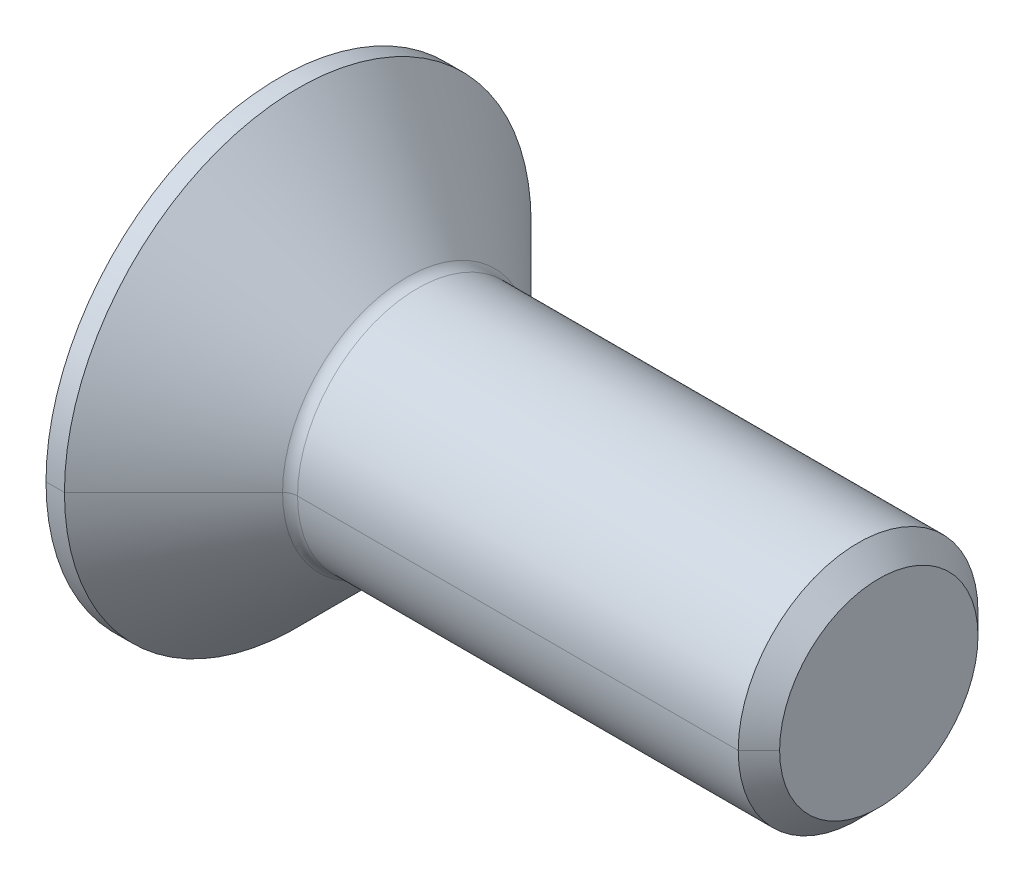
ISO-10303-21;
HEADER;
FILE_DESCRIPTION(('STEP AP214'),'2;1');
FILE_NAME('part.step','',(''),(''),'','','');
FILE_SCHEMA(('AUTOMOTIVE_DESIGN { 1 0 10303 214 1 1 1 1 }'));
ENDSEC;
DATA;
#1=APPLICATION_CONTEXT('core data for automotive mechanical design processes');
#2=APPLICATION_PROTOCOL_DEFINITION('international standard','automotive_design',2000,#1);
#3=PRODUCT_CONTEXT('',#1,'mechanical');
#4=PRODUCT('Part','Part','',(#3));
#5=PRODUCT_RELATED_PRODUCT_CATEGORY('part','',(#4));
#6=PRODUCT_DEFINITION_FORMATION('','',#4);
#7=PRODUCT_DEFINITION_CONTEXT('part definition',#1,'design');
#8=PRODUCT_DEFINITION('design','',#6,#7);
#9=PRODUCT_DEFINITION_SHAPE('','',#8);
#10=(LENGTH_UNIT() NAMED_UNIT(*) SI_UNIT(.MILLI.,.METRE.));
#11=(NAMED_UNIT(*) PLANE_ANGLE_UNIT() SI_UNIT($,.RADIAN.));
#12=(NAMED_UNIT(*) SI_UNIT($,.STERADIAN.) SOLID_ANGLE_UNIT());
#13=UNCERTAINTY_MEASURE_WITH_UNIT(LENGTH_MEASURE(1.E-05),#10,'distance_accuracy_value','');
#14=(GEOMETRIC_REPRESENTATION_CONTEXT(3) GLOBAL_UNCERTAINTY_ASSIGNED_CONTEXT((#13)) GLOBAL_UNIT_ASSIGNED_CONTEXT((#10,
#11,#12)) REPRESENTATION_CONTEXT('',''));
#15=CARTESIAN_POINT('',(0.,0.,0.));
#16=DIRECTION('',(0.,0.,1.));
#17=DIRECTION('',(1.,0.,0.));
#18=AXIS2_PLACEMENT_3D('',#15,#16,#17);
#19=CARTESIAN_POINT('',(-3.35653485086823,2.41305314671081,-1.18741092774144));
#20=DIRECTION('',(-1.,0.,0.));
#21=DIRECTION('',(0.,0.,1.));
#22=AXIS2_PLACEMENT_3D('',#19,#20,#21);
#23=CONICAL_SURFACE('',#22,2.51,1.0471975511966);
#24=DIRECTION('',(-0.5,0.,-0.866025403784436));
#25=VECTOR('',#24,1.);
#26=CARTESIAN_POINT('',(-3.35653485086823,2.41305314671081,-3.69741092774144));
#27=LINE('',#26,#25);
#28=CARTESIAN_POINT('',(-1.90738567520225,2.41305314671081,-1.18741092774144));
#29=VERTEX_POINT('',#28);
#30=CARTESIAN_POINT('',(-3.35653485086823,2.41305314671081,-3.69741092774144));
#31=VERTEX_POINT('',#30);
#32=EDGE_CURVE('E240',#29,#31,#27,.T.);
#33=ORIENTED_EDGE('',*,*,#32,.F.);
#34=DIRECTION('',(-0.5,0.,0.866025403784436));
#35=VECTOR('',#34,1.);
#36=CARTESIAN_POINT('',(-3.35653485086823,2.41305314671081,1.32258907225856));
#37=LINE('',#36,#35);
#38=CARTESIAN_POINT('',(-3.35653485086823,2.41305314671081,1.32258907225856));
#39=VERTEX_POINT('',#38);
#40=EDGE_CURVE('E1229',#29,#39,#37,.T.);
#41=ORIENTED_EDGE('',*,*,#40,.T.);
#42=CARTESIAN_POINT('',(-3.35653485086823,2.41305314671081,-1.18741092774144));
#43=DIRECTION('',(-1.,0.,0.));
#44=DIRECTION('',(0.,0.,1.));
#45=AXIS2_PLACEMENT_3D('',#42,#43,#44);
#46=CIRCLE('',#45,2.51);
#47=CARTESIAN_POINT('',(-3.35653485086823,4.58677691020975,0.0675890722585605));
#48=VERTEX_POINT('',#47);
#49=EDGE_CURVE('E10',#39,#48,#46,.T.);
#50=ORIENTED_EDGE('',*,*,#49,.T.);
#51=CARTESIAN_POINT('',(-3.35653485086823,2.41305314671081,-1.18741092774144));
#52=DIRECTION('',(-1.,0.,0.));
#53=DIRECTION('',(0.,0.,1.));
#54=AXIS2_PLACEMENT_3D('',#51,#52,#53);
#55=CIRCLE('',#54,2.51);
#56=CARTESIAN_POINT('',(-3.35653485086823,4.58677691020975,-2.44241092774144));
#57=VERTEX_POINT('',#56);
#58=EDGE_CURVE('E24',#48,#57,#55,.T.);
#59=ORIENTED_EDGE('',*,*,#58,.T.);
#60=CARTESIAN_POINT('',(-3.35653485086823,2.41305314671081,-1.18741092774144));
#61=DIRECTION('',(-1.,0.,0.));
#62=DIRECTION('',(0.,0.,1.));
#63=AXIS2_PLACEMENT_3D('',#60,#61,#62);
#64=CIRCLE('',#63,2.51);
#65=EDGE_CURVE('E212',#57,#31,#64,.T.);
#66=ORIENTED_EDGE('',*,*,#65,.T.);
#67=EDGE_LOOP('',(#33,#41,#50,#59,#66));
#68=FACE_BOUND('',#67,.T.);
#69=ADVANCED_FACE('F15',(#68),#23,.F.);
#70=CARTESIAN_POINT('',(-3.35653485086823,-1.93439438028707,1.32258907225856));
#71=DIRECTION('',(-1.,0.,0.));
#72=DIRECTION('',(0.,0.,1.));
#73=AXIS2_PLACEMENT_3D('',#70,#71,#72);
#74=PLANE('',#73);
#75=ORIENTED_EDGE('',*,*,#49,.F.);
#76=DIRECTION('',(0.,-1.,0.));
#77=VECTOR('',#76,1.);
#78=CARTESIAN_POINT('',(-3.35653485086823,3.86220232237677,1.32258907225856));
#79=LINE('',#78,#77);
#80=CARTESIAN_POINT('',(-3.35653485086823,3.86220232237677,1.32258907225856));
#81=VERTEX_POINT('',#80);
#82=EDGE_CURVE('E51',#81,#39,#79,.T.);
#83=ORIENTED_EDGE('',*,*,#82,.F.);
#84=DIRECTION('',(0.,-0.5,0.866025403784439));
#85=VECTOR('',#84,1.);
#86=CARTESIAN_POINT('',(-3.35653485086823,5.31135149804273,-1.18741092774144));
#87=LINE('',#86,#85);
#88=EDGE_CURVE('E373',#48,#81,#87,.T.);
#89=ORIENTED_EDGE('',*,*,#88,.F.);
#90=EDGE_LOOP('',(#75,#83,#89));
#91=FACE_BOUND('',#90,.T.);
#92=ADVANCED_FACE('F17',(#91),#74,.T.);
#93=CARTESIAN_POINT('',(-3.35653485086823,-1.93439438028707,1.32258907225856));
#94=DIRECTION('',(-1.,0.,0.));
#95=DIRECTION('',(0.,0.,1.));
#96=AXIS2_PLACEMENT_3D('',#93,#94,#95);
#97=PLANE('',#96);
#98=ORIENTED_EDGE('',*,*,#58,.F.);
#99=DIRECTION('',(0.,-0.5,0.866025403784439));
#100=VECTOR('',#99,1.);
#101=CARTESIAN_POINT('',(-3.35653485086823,5.31135149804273,-1.18741092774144));
#102=LINE('',#101,#100);
#103=CARTESIAN_POINT('',(-3.35653485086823,5.31135149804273,-1.18741092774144));
#104=VERTEX_POINT('',#103);
#105=EDGE_CURVE('E122',#104,#48,#102,.T.);
#106=ORIENTED_EDGE('',*,*,#105,.F.);
#107=DIRECTION('',(0.,0.5,0.866025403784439));
#108=VECTOR('',#107,1.);
#109=CARTESIAN_POINT('',(-3.35653485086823,3.86220232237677,-3.69741092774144));
#110=LINE('',#109,#108);
#111=EDGE_CURVE('E364',#57,#104,#110,.T.);
#112=ORIENTED_EDGE('',*,*,#111,.F.);
#113=EDGE_LOOP('',(#98,#106,#112));
#114=FACE_BOUND('',#113,.T.);
#115=ADVANCED_FACE('F921',(#114),#97,.T.);
#116=CARTESIAN_POINT('',(-3.35653485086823,-1.93439438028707,1.32258907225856));
#117=DIRECTION('',(-1.,0.,0.));
#118=DIRECTION('',(0.,0.,1.));
#119=AXIS2_PLACEMENT_3D('',#116,#117,#118);
#120=PLANE('',#119);
#121=ORIENTED_EDGE('',*,*,#65,.F.);
#122=DIRECTION('',(0.,0.5,0.866025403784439));
#123=VECTOR('',#122,1.);
#124=CARTESIAN_POINT('',(-3.35653485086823,3.86220232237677,-3.69741092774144));
#125=LINE('',#124,#123);
#126=CARTESIAN_POINT('',(-3.35653485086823,3.86220232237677,-3.69741092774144));
#127=VERTEX_POINT('',#126);
#128=EDGE_CURVE('E359',#127,#57,#125,.T.);
#129=ORIENTED_EDGE('',*,*,#128,.F.);
#130=DIRECTION('',(0.,1.,0.));
#131=VECTOR('',#130,1.);
#132=CARTESIAN_POINT('',(-3.35653485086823,0.963903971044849,-3.69741092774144));
#133=LINE('',#132,#131);
#134=EDGE_CURVE('E296',#31,#127,#133,.T.);
#135=ORIENTED_EDGE('',*,*,#134,.F.);
#136=EDGE_LOOP('',(#121,#129,#135));
#137=FACE_BOUND('',#136,.T.);
#138=ADVANCED_FACE('F909',(#137),#120,.T.);
#139=CARTESIAN_POINT('',(-3.35653485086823,-1.93439438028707,1.32258907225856));
#140=DIRECTION('',(-1.,0.,0.));
#141=DIRECTION('',(0.,0.,1.));
#142=AXIS2_PLACEMENT_3D('',#139,#140,#141);
#143=PLANE('',#142);
#144=CARTESIAN_POINT('',(-3.35653485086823,2.41305314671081,-1.18741092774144));
#145=DIRECTION('',(-1.,0.,0.));
#146=DIRECTION('',(0.,0.,1.));
#147=AXIS2_PLACEMENT_3D('',#144,#145,#146);
#148=CIRCLE('',#147,2.51);
#149=CARTESIAN_POINT('',(-3.35653485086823,0.239329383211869,-2.44241092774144));
#150=VERTEX_POINT('',#149);
#151=EDGE_CURVE('E233',#31,#150,#148,.T.);
#152=ORIENTED_EDGE('',*,*,#151,.F.);
#153=DIRECTION('',(0.,1.,0.));
#154=VECTOR('',#153,1.);
#155=CARTESIAN_POINT('',(-3.35653485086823,0.963903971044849,-3.69741092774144));
#156=LINE('',#155,#154);
#157=CARTESIAN_POINT('',(-3.35653485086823,0.963903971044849,-3.69741092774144));
#158=VERTEX_POINT('',#157);
#159=EDGE_CURVE('E301',#158,#31,#156,.T.);
#160=ORIENTED_EDGE('',*,*,#159,.F.);
#161=DIRECTION('',(0.,0.5,-0.866025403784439));
#162=VECTOR('',#161,1.);
#163=CARTESIAN_POINT('',(-3.35653485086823,-0.485245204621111,-1.18741092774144));
#164=LINE('',#163,#162);
#165=EDGE_CURVE('E346',#150,#158,#164,.T.);
#166=ORIENTED_EDGE('',*,*,#165,.F.);
#167=EDGE_LOOP('',(#152,#160,#166));
#168=FACE_BOUND('',#167,.T.);
#169=ADVANCED_FACE('F898',(#168),#143,.T.);
#170=CARTESIAN_POINT('',(-3.35653485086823,-1.93439438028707,1.32258907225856));
#171=DIRECTION('',(-1.,0.,0.));
#172=DIRECTION('',(0.,0.,1.));
#173=AXIS2_PLACEMENT_3D('',#170,#171,#172);
#174=PLANE('',#173);
#175=CARTESIAN_POINT('',(-3.35653485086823,2.41305314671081,-1.18741092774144));
#176=DIRECTION('',(-1.,0.,0.));
#177=DIRECTION('',(0.,0.,1.));
#178=AXIS2_PLACEMENT_3D('',#175,#176,#177);
#179=CIRCLE('',#178,2.51);
#180=CARTESIAN_POINT('',(-3.35653485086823,0.239329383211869,0.0675890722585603));
#181=VERTEX_POINT('',#180);
#182=EDGE_CURVE('E205',#150,#181,#179,.T.);
#183=ORIENTED_EDGE('',*,*,#182,.F.);
#184=DIRECTION('',(0.,0.5,-0.866025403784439));
#185=VECTOR('',#184,1.);
#186=CARTESIAN_POINT('',(-3.35653485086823,-0.485245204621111,-1.18741092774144));
#187=LINE('',#186,#185);
#188=CARTESIAN_POINT('',(-3.35653485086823,-0.485245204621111,-1.18741092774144));
#189=VERTEX_POINT('',#188);
#190=EDGE_CURVE('E208',#189,#150,#187,.T.);
#191=ORIENTED_EDGE('',*,*,#190,.F.);
#192=DIRECTION('',(0.,-0.5,-0.866025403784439));
#193=VECTOR('',#192,1.);
#194=CARTESIAN_POINT('',(-3.35653485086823,0.963903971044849,1.32258907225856));
#195=LINE('',#194,#193);
#196=EDGE_CURVE('E202',#181,#189,#195,.T.);
#197=ORIENTED_EDGE('',*,*,#196,.F.);
#198=EDGE_LOOP('',(#183,#191,#197));
#199=FACE_BOUND('',#198,.T.);
#200=ADVANCED_FACE('F203',(#199),#174,.T.);
#201=CARTESIAN_POINT('',(-3.35653485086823,-1.93439438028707,1.32258907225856));
#202=DIRECTION('',(-1.,0.,0.));
#203=DIRECTION('',(0.,0.,1.));
#204=AXIS2_PLACEMENT_3D('',#201,#202,#203);
#205=PLANE('',#204);
#206=CARTESIAN_POINT('',(-3.35653485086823,2.41305314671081,-1.18741092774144));
#207=DIRECTION('',(-1.,0.,0.));
#208=DIRECTION('',(0.,0.,1.));
#209=AXIS2_PLACEMENT_3D('',#206,#207,#208);
#210=CIRCLE('',#209,2.51);
#211=EDGE_CURVE('E221',#181,#39,#210,.T.);
#212=ORIENTED_EDGE('',*,*,#211,.F.);
#213=DIRECTION('',(0.,-0.5,-0.866025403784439));
#214=VECTOR('',#213,1.);
#215=CARTESIAN_POINT('',(-3.35653485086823,0.963903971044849,1.32258907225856));
#216=LINE('',#215,#214);
#217=CARTESIAN_POINT('',(-3.35653485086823,0.963903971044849,1.32258907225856));
#218=VERTEX_POINT('',#217);
#219=EDGE_CURVE('E37',#218,#181,#216,.T.);
#220=ORIENTED_EDGE('',*,*,#219,.F.);
#221=DIRECTION('',(0.,-1.,0.));
#222=VECTOR('',#221,1.);
#223=CARTESIAN_POINT('',(-3.35653485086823,3.86220232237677,1.32258907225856));
#224=LINE('',#223,#222);
#225=EDGE_CURVE('E223',#39,#218,#224,.T.);
#226=ORIENTED_EDGE('',*,*,#225,.F.);
#227=EDGE_LOOP('',(#212,#220,#226));
#228=FACE_BOUND('',#227,.T.);
#229=ADVANCED_FACE('F222',(#228),#205,.T.);
#230=CARTESIAN_POINT('',(-3.35653485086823,0.963903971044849,1.32258907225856));
#231=DIRECTION('',(0.,0.866025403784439,-0.5));
#232=DIRECTION('',(-1.,0.,0.));
#233=AXIS2_PLACEMENT_3D('',#230,#231,#232);
#234=PLANE('',#233);
#235=DIRECTION('',(0.,-0.5,-0.866025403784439));
#236=VECTOR('',#235,1.);
#237=CARTESIAN_POINT('',(-6.85653485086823,0.963903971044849,1.32258907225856));
#238=LINE('',#237,#236);
#239=CARTESIAN_POINT('',(-6.85653485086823,0.963903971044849,1.32258907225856));
#240=VERTEX_POINT('',#239);
#241=CARTESIAN_POINT('',(-6.85653485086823,-0.485245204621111,-1.18741092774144));
#242=VERTEX_POINT('',#241);
#243=EDGE_CURVE('E319',#240,#242,#238,.T.);
#244=ORIENTED_EDGE('',*,*,#243,.F.);
#245=DIRECTION('',(-1.,0.,0.));
#246=VECTOR('',#245,1.);
#247=CARTESIAN_POINT('',(-3.35653485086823,0.963903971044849,1.32258907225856));
#248=LINE('',#247,#246);
#249=EDGE_CURVE('E216',#218,#240,#248,.T.);
#250=ORIENTED_EDGE('',*,*,#249,.F.);
#251=ORIENTED_EDGE('',*,*,#219,.T.);
#252=ORIENTED_EDGE('',*,*,#196,.T.);
#253=DIRECTION('',(-1.,0.,0.));
#254=VECTOR('',#253,1.);
#255=CARTESIAN_POINT('',(-3.35653485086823,-0.485245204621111,-1.18741092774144));
#256=LINE('',#255,#254);
#257=EDGE_CURVE('E262',#189,#242,#256,.T.);
#258=ORIENTED_EDGE('',*,*,#257,.T.);
#259=EDGE_LOOP('',(#244,#250,#251,#252,#258));
#260=FACE_BOUND('',#259,.T.);
#261=ADVANCED_FACE('F215',(#260),#234,.T.);
#262=CARTESIAN_POINT('',(-3.35653485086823,3.86220232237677,1.32258907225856));
#263=DIRECTION('',(0.,0.,-1.));
#264=DIRECTION('',(0.,-1.,0.));
#265=AXIS2_PLACEMENT_3D('',#262,#263,#264);
#266=PLANE('',#265);
#267=DIRECTION('',(0.,-1.,0.));
#268=VECTOR('',#267,1.);
#269=CARTESIAN_POINT('',(-6.85653485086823,3.86220232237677,1.32258907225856));
#270=LINE('',#269,#268);
#271=CARTESIAN_POINT('',(-6.85653485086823,3.86220232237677,1.32258907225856));
#272=VERTEX_POINT('',#271);
#273=EDGE_CURVE('E333',#272,#240,#270,.T.);
#274=ORIENTED_EDGE('',*,*,#273,.F.);
#275=DIRECTION('',(-1.,0.,0.));
#276=VECTOR('',#275,1.);
#277=CARTESIAN_POINT('',(-3.35653485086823,3.86220232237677,1.32258907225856));
#278=LINE('',#277,#276);
#279=EDGE_CURVE('E377',#81,#272,#278,.T.);
#280=ORIENTED_EDGE('',*,*,#279,.F.);
#281=ORIENTED_EDGE('',*,*,#82,.T.);
#282=ORIENTED_EDGE('',*,*,#225,.T.);
#283=ORIENTED_EDGE('',*,*,#249,.T.);
#284=EDGE_LOOP('',(#274,#280,#281,#282,#283));
#285=FACE_BOUND('',#284,.T.);
#286=ADVANCED_FACE('F689',(#285),#266,.T.);
#287=CARTESIAN_POINT('',(-3.35653485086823,5.31135149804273,-1.18741092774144));
#288=DIRECTION('',(0.,-0.866025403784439,-0.5));
#289=DIRECTION('',(0.,0.5,-0.866025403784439));
#290=AXIS2_PLACEMENT_3D('',#287,#288,#289);
#291=PLANE('',#290);
#292=DIRECTION('',(0.,-0.5,0.866025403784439));
#293=VECTOR('',#292,1.);
#294=CARTESIAN_POINT('',(-6.85653485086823,5.31135149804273,-1.18741092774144));
#295=LINE('',#294,#293);
#296=CARTESIAN_POINT('',(-6.85653485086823,5.31135149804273,-1.18741092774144));
#297=VERTEX_POINT('',#296);
#298=EDGE_CURVE('E329',#297,#272,#295,.T.);
#299=ORIENTED_EDGE('',*,*,#298,.F.);
#300=DIRECTION('',(-1.,0.,0.));
#301=VECTOR('',#300,1.);
#302=CARTESIAN_POINT('',(-3.35653485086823,5.31135149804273,-1.18741092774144));
#303=LINE('',#302,#301);
#304=EDGE_CURVE('E368',#104,#297,#303,.T.);
#305=ORIENTED_EDGE('',*,*,#304,.F.);
#306=ORIENTED_EDGE('',*,*,#105,.T.);
#307=ORIENTED_EDGE('',*,*,#88,.T.);
#308=ORIENTED_EDGE('',*,*,#279,.T.);
#309=EDGE_LOOP('',(#299,#305,#306,#307,#308));
#310=FACE_BOUND('',#309,.T.);
#311=ADVANCED_FACE('F693',(#310),#291,.T.);
#312=CARTESIAN_POINT('',(-3.35653485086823,3.86220232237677,-3.69741092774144));
#313=DIRECTION('',(0.,-0.866025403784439,0.5));
#314=DIRECTION('',(-1.,0.,0.));
#315=AXIS2_PLACEMENT_3D('',#312,#313,#314);
#316=PLANE('',#315);
#317=DIRECTION('',(0.,0.5,0.866025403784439));
#318=VECTOR('',#317,1.);
#319=CARTESIAN_POINT('',(-6.85653485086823,3.86220232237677,-3.69741092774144));
#320=LINE('',#319,#318);
#321=CARTESIAN_POINT('',(-6.85653485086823,3.86220232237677,-3.69741092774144));
#322=VERTEX_POINT('',#321);
#323=EDGE_CURVE('E248',#322,#297,#320,.T.);
#324=ORIENTED_EDGE('',*,*,#323,.F.);
#325=DIRECTION('',(-1.,0.,0.));
#326=VECTOR('',#325,1.);
#327=CARTESIAN_POINT('',(-3.35653485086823,3.86220232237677,-3.69741092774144));
#328=LINE('',#327,#326);
#329=EDGE_CURVE('E300',#127,#322,#328,.T.);
#330=ORIENTED_EDGE('',*,*,#329,.F.);
#331=ORIENTED_EDGE('',*,*,#128,.T.);
#332=ORIENTED_EDGE('',*,*,#111,.T.);
#333=ORIENTED_EDGE('',*,*,#304,.T.);
#334=EDGE_LOOP('',(#324,#330,#331,#332,#333));
#335=FACE_BOUND('',#334,.T.);
#336=ADVANCED_FACE('F780',(#335),#316,.T.);
#337=CARTESIAN_POINT('',(-3.35653485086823,0.963903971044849,-3.69741092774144));
#338=DIRECTION('',(0.,0.,1.));
#339=DIRECTION('',(0.,-1.,0.));
#340=AXIS2_PLACEMENT_3D('',#337,#338,#339);
#341=PLANE('',#340);
#342=DIRECTION('',(0.,1.,0.));
#343=VECTOR('',#342,1.);
#344=CARTESIAN_POINT('',(-6.85653485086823,0.963903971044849,-3.69741092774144));
#345=LINE('',#344,#343);
#346=CARTESIAN_POINT('',(-6.85653485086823,0.963903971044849,-3.69741092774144));
#347=VERTEX_POINT('',#346);
#348=EDGE_CURVE('E245',#347,#322,#345,.T.);
#349=ORIENTED_EDGE('',*,*,#348,.F.);
#350=DIRECTION('',(-1.,0.,0.));
#351=VECTOR('',#350,1.);
#352=CARTESIAN_POINT('',(-3.35653485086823,0.963903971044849,-3.69741092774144));
#353=LINE('',#352,#351);
#354=EDGE_CURVE('E350',#158,#347,#353,.T.);
#355=ORIENTED_EDGE('',*,*,#354,.F.);
#356=ORIENTED_EDGE('',*,*,#159,.T.);
#357=ORIENTED_EDGE('',*,*,#134,.T.);
#358=ORIENTED_EDGE('',*,*,#329,.T.);
#359=EDGE_LOOP('',(#349,#355,#356,#357,#358));
#360=FACE_BOUND('',#359,.T.);
#361=ADVANCED_FACE('F719',(#360),#341,.T.);
#362=CARTESIAN_POINT('',(-3.35653485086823,-0.485245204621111,-1.18741092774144));
#363=DIRECTION('',(0.,0.866025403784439,0.5));
#364=DIRECTION('',(1.,0.,0.));
#365=AXIS2_PLACEMENT_3D('',#362,#363,#364);
#366=PLANE('',#365);
#367=DIRECTION('',(0.,0.5,-0.866025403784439));
#368=VECTOR('',#367,1.);
#369=CARTESIAN_POINT('',(-6.85653485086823,-0.485245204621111,-1.18741092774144));
#370=LINE('',#369,#368);
#371=EDGE_CURVE('E249',#242,#347,#370,.T.);
#372=ORIENTED_EDGE('',*,*,#371,.F.);
#373=ORIENTED_EDGE('',*,*,#257,.F.);
#374=ORIENTED_EDGE('',*,*,#190,.T.);
#375=ORIENTED_EDGE('',*,*,#165,.T.);
#376=ORIENTED_EDGE('',*,*,#354,.T.);
#377=EDGE_LOOP('',(#372,#373,#374,#375,#376));
#378=FACE_BOUND('',#377,.T.);
#379=ADVANCED_FACE('F714',(#378),#366,.T.);
#380=CARTESIAN_POINT('',(-2.24942806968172,2.41305314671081,-1.18741092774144));
#381=DIRECTION('',(-1.,0.,0.));
#382=DIRECTION('',(0.,0.,1.));
#383=AXIS2_PLACEMENT_3D('',#380,#381,#382);
#384=TOROIDAL_SURFACE('',#383,4.5,0.5);
#385=CARTESIAN_POINT('',(-2.24942806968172,2.41305314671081,-5.68741092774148));
#386=DIRECTION('',(0.,1.,0.));
#387=DIRECTION('',(0.,0.,1.));
#388=AXIS2_PLACEMENT_3D('',#385,#386,#387);
#389=CIRCLE('',#388,0.5);
#390=CARTESIAN_POINT('',(-2.60298146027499,2.41305314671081,-5.3338575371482));
#391=VERTEX_POINT('',#390);
#392=CARTESIAN_POINT('',(-2.24942806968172,2.41305314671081,-5.18741092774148));
#393=VERTEX_POINT('',#392);
#394=EDGE_CURVE('E251',#391,#393,#389,.T.);
#395=ORIENTED_EDGE('',*,*,#394,.F.);
#396=CARTESIAN_POINT('',(-2.60298146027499,2.41305314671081,-1.18741092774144));
#397=DIRECTION('',(-1.,0.,0.));
#398=DIRECTION('',(0.,0.,1.));
#399=AXIS2_PLACEMENT_3D('',#396,#397,#398);
#400=CIRCLE('',#399,4.14644660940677);
#401=CARTESIAN_POINT('',(-2.60298146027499,2.41305314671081,2.95903568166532));
#402=VERTEX_POINT('',#401);
#403=EDGE_CURVE('E289',#402,#391,#400,.T.);
#404=ORIENTED_EDGE('',*,*,#403,.F.);
#405=CARTESIAN_POINT('',(-2.24942806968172,2.41305314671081,3.3125890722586));
#406=DIRECTION('',(0.,-1.,0.));
#407=DIRECTION('',(0.,0.,-1.));
#408=AXIS2_PLACEMENT_3D('',#405,#406,#407);
#409=CIRCLE('',#408,0.5);
#410=CARTESIAN_POINT('',(-2.24942806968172,2.41305314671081,2.8125890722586));
#411=VERTEX_POINT('',#410);
#412=EDGE_CURVE('E269',#402,#411,#409,.T.);
#413=ORIENTED_EDGE('',*,*,#412,.T.);
#414=CARTESIAN_POINT('',(-2.24942806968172,2.41305314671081,-1.18741092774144));
#415=DIRECTION('',(1.,0.,0.));
#416=DIRECTION('',(0.,0.,1.));
#417=AXIS2_PLACEMENT_3D('',#414,#415,#416);
#418=CIRCLE('',#417,4.);
#419=EDGE_CURVE('E305',#393,#411,#418,.T.);
#420=ORIENTED_EDGE('',*,*,#419,.F.);
#421=EDGE_LOOP('',(#395,#404,#413,#420));
#422=FACE_BOUND('',#421,.T.);
#423=ADVANCED_FACE('F718',(#422),#384,.F.);
#424=CARTESIAN_POINT('',(-6.85653485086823,2.41305314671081,-1.18741092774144));
#425=DIRECTION('',(-1.,0.,0.));
#426=DIRECTION('',(0.,0.,1.));
#427=AXIS2_PLACEMENT_3D('',#424,#425,#426);
#428=CYLINDRICAL_SURFACE('',#427,7.785);
#429=DIRECTION('',(-1.,0.,0.));
#430=VECTOR('',#429,1.);
#431=CARTESIAN_POINT('',(-6.85653485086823,2.41305314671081,-8.97241092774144));
#432=LINE('',#431,#430);
#433=CARTESIAN_POINT('',(-6.24153485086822,2.41305314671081,-8.97241092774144));
#434=VERTEX_POINT('',#433);
#435=CARTESIAN_POINT('',(-6.85653485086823,2.41305314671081,-8.97241092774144));
#436=VERTEX_POINT('',#435);
#437=EDGE_CURVE('E259',#434,#436,#432,.T.);
#438=ORIENTED_EDGE('',*,*,#437,.F.);
#439=CARTESIAN_POINT('',(-6.24153485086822,2.41305314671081,-1.18741092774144));
#440=DIRECTION('',(-1.,0.,0.));
#441=DIRECTION('',(0.,0.,1.));
#442=AXIS2_PLACEMENT_3D('',#439,#440,#441);
#443=CIRCLE('',#442,7.785);
#444=CARTESIAN_POINT('',(-6.24153485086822,2.41305314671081,6.59758907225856));
#445=VERTEX_POINT('',#444);
#446=EDGE_CURVE('E154',#434,#445,#443,.T.);
#447=ORIENTED_EDGE('',*,*,#446,.T.);
#448=DIRECTION('',(-1.,0.,0.));
#449=VECTOR('',#448,1.);
#450=CARTESIAN_POINT('',(-6.85653485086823,2.41305314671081,6.59758907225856));
#451=LINE('',#450,#449);
#452=CARTESIAN_POINT('',(-6.85653485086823,2.41305314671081,6.59758907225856));
#453=VERTEX_POINT('',#452);
#454=EDGE_CURVE('E244',#445,#453,#451,.T.);
#455=ORIENTED_EDGE('',*,*,#454,.T.);
#456=CARTESIAN_POINT('',(-6.85653485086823,2.41305314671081,-1.18741092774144));
#457=DIRECTION('',(-1.,0.,0.));
#458=DIRECTION('',(0.,0.,1.));
#459=AXIS2_PLACEMENT_3D('',#456,#457,#458);
#460=CIRCLE('',#459,7.785);
#461=EDGE_CURVE('E163',#436,#453,#460,.T.);
#462=ORIENTED_EDGE('',*,*,#461,.F.);
#463=EDGE_LOOP('',(#438,#447,#455,#462));
#464=FACE_BOUND('',#463,.T.);
#465=ADVANCED_FACE('F835',(#464),#428,.T.);
#466=CARTESIAN_POINT('',(-6.24153485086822,2.41305314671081,-1.18741092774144));
#467=DIRECTION('',(-1.,0.,0.));
#468=DIRECTION('',(0.,0.,1.));
#469=AXIS2_PLACEMENT_3D('',#466,#467,#468);
#470=CONICAL_SURFACE('',#469,7.785,0.78539816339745);
#471=DIRECTION('',(-0.707106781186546,0.,-0.707106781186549));
#472=VECTOR('',#471,1.);
#473=CARTESIAN_POINT('',(-6.24153485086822,2.41305314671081,-8.97241092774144));
#474=LINE('',#473,#472);
#475=EDGE_CURVE('E293',#391,#434,#474,.T.);
#476=ORIENTED_EDGE('',*,*,#475,.F.);
#477=CARTESIAN_POINT('',(-2.60298146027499,2.41305314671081,-1.18741092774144));
#478=DIRECTION('',(-1.,0.,0.));
#479=DIRECTION('',(0.,0.,1.));
#480=AXIS2_PLACEMENT_3D('',#477,#478,#479);
#481=CIRCLE('',#480,4.14644660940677);
#482=EDGE_CURVE('E228',#391,#402,#481,.T.);
#483=ORIENTED_EDGE('',*,*,#482,.T.);
#484=DIRECTION('',(-0.707106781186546,0.,0.707106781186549));
#485=VECTOR('',#484,1.);
#486=CARTESIAN_POINT('',(-6.24153485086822,2.41305314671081,6.59758907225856));
#487=LINE('',#486,#485);
#488=EDGE_CURVE('E268',#402,#445,#487,.T.);
#489=ORIENTED_EDGE('',*,*,#488,.T.);
#490=ORIENTED_EDGE('',*,*,#446,.F.);
#491=EDGE_LOOP('',(#476,#483,#489,#490));
#492=FACE_BOUND('',#491,.T.);
#493=ADVANCED_FACE('F803',(#492),#470,.T.);
#494=CARTESIAN_POINT('',(-6.85653485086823,2.41305314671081,-1.18741092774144));
#495=DIRECTION('',(-1.,0.,0.));
#496=DIRECTION('',(0.,0.,1.));
#497=AXIS2_PLACEMENT_3D('',#494,#495,#496);
#498=CYLINDRICAL_SURFACE('',#497,4.);
#499=DIRECTION('',(-1.,0.,0.));
#500=VECTOR('',#499,1.);
#501=CARTESIAN_POINT('',(-6.85653485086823,2.41305314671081,-5.18741092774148));
#502=LINE('',#501,#500);
#503=CARTESIAN_POINT('',(12.4529651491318,2.41305314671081,-5.18741092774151));
#504=VERTEX_POINT('',#503);
#505=EDGE_CURVE('E267',#504,#393,#502,.T.);
#506=ORIENTED_EDGE('',*,*,#505,.F.);
#507=CARTESIAN_POINT('',(12.4529651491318,2.41305314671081,-1.18741092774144));
#508=DIRECTION('',(-1.,0.,0.));
#509=DIRECTION('',(0.,0.,1.));
#510=AXIS2_PLACEMENT_3D('',#507,#508,#509);
#511=CIRCLE('',#510,4.00000000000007);
#512=CARTESIAN_POINT('',(12.4529651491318,2.41305314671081,2.81258907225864));
#513=VERTEX_POINT('',#512);
#514=EDGE_CURVE('E178',#504,#513,#511,.T.);
#515=ORIENTED_EDGE('',*,*,#514,.T.);
#516=DIRECTION('',(-1.,0.,0.));
#517=VECTOR('',#516,1.);
#518=CARTESIAN_POINT('',(-6.85653485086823,2.41305314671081,2.8125890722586));
#519=LINE('',#518,#517);
#520=EDGE_CURVE('E285',#513,#411,#519,.T.);
#521=ORIENTED_EDGE('',*,*,#520,.T.);
#522=CARTESIAN_POINT('',(-2.24942806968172,2.41305314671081,-1.18741092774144));
#523=DIRECTION('',(1.,0.,0.));
#524=DIRECTION('',(0.,0.,1.));
#525=AXIS2_PLACEMENT_3D('',#522,#523,#524);
#526=CIRCLE('',#525,4.);
#527=EDGE_CURVE('E255',#411,#393,#526,.T.);
#528=ORIENTED_EDGE('',*,*,#527,.T.);
#529=EDGE_LOOP('',(#506,#515,#521,#528));
#530=FACE_BOUND('',#529,.T.);
#531=ADVANCED_FACE('F733',(#530),#498,.T.);
#532=CARTESIAN_POINT('',(13.1434651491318,2.41305314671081,-1.18741092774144));
#533=DIRECTION('',(-1.,0.,0.));
#534=DIRECTION('',(0.,0.,1.));
#535=AXIS2_PLACEMENT_3D('',#532,#533,#534);
#536=CONICAL_SURFACE('',#535,3.3095,0.785398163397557);
#537=DIRECTION('',(-0.707106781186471,0.,-0.707106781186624));
#538=VECTOR('',#537,1.);
#539=CARTESIAN_POINT('',(13.1434651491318,2.41305314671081,-4.49691092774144));
#540=LINE('',#539,#538);
#541=CARTESIAN_POINT('',(13.1434651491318,2.41305314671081,-4.49691092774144));
#542=VERTEX_POINT('',#541);
#543=EDGE_CURVE('E284',#542,#504,#540,.T.);
#544=ORIENTED_EDGE('',*,*,#543,.F.);
#545=CARTESIAN_POINT('',(13.1434651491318,2.41305314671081,-1.18741092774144));
#546=DIRECTION('',(-1.,0.,0.));
#547=DIRECTION('',(0.,0.,1.));
#548=AXIS2_PLACEMENT_3D('',#545,#546,#547);
#549=CIRCLE('',#548,3.3095);
#550=CARTESIAN_POINT('',(13.1434651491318,2.41305314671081,2.12208907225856));
#551=VERTEX_POINT('',#550);
#552=EDGE_CURVE('E337',#542,#551,#549,.T.);
#553=ORIENTED_EDGE('',*,*,#552,.T.);
#554=DIRECTION('',(-0.707106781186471,0.,0.707106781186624));
#555=VECTOR('',#554,1.);
#556=CARTESIAN_POINT('',(13.1434651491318,2.41305314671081,2.12208907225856));
#557=LINE('',#556,#555);
#558=EDGE_CURVE('E306',#551,#513,#557,.T.);
#559=ORIENTED_EDGE('',*,*,#558,.T.);
#560=ORIENTED_EDGE('',*,*,#514,.F.);
#561=EDGE_LOOP('',(#544,#553,#559,#560));
#562=FACE_BOUND('',#561,.T.);
#563=ADVANCED_FACE('F728',(#562),#536,.T.);
#564=CARTESIAN_POINT('',(13.1434651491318,5.72255314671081,-1.18741092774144));
#565=DIRECTION('',(1.,0.,0.));
#566=DIRECTION('',(0.,1.,0.));
#567=AXIS2_PLACEMENT_3D('',#564,#565,#566);
#568=PLANE('',#567);
#569=CARTESIAN_POINT('',(13.1434651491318,2.41305314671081,-1.18741092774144));
#570=DIRECTION('',(-1.,0.,0.));
#571=DIRECTION('',(0.,0.,1.));
#572=AXIS2_PLACEMENT_3D('',#569,#570,#571);
#573=CIRCLE('',#572,3.3095);
#574=EDGE_CURVE('E280',#551,#542,#573,.T.);
#575=ORIENTED_EDGE('',*,*,#574,.F.);
#576=ORIENTED_EDGE('',*,*,#552,.F.);
#577=EDGE_LOOP('',(#575,#576));
#578=FACE_BOUND('',#577,.T.);
#579=ADVANCED_FACE('F732',(#578),#568,.T.);
#580=CARTESIAN_POINT('',(-6.85653485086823,2.41305314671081,-1.18741092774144));
#581=DIRECTION('',(-1.,0.,0.));
#582=DIRECTION('',(0.,0.,1.));
#583=AXIS2_PLACEMENT_3D('',#580,#581,#582);
#584=PLANE('',#583);
#585=ORIENTED_EDGE('',*,*,#243,.T.);
#586=ORIENTED_EDGE('',*,*,#371,.T.);
#587=ORIENTED_EDGE('',*,*,#348,.T.);
#588=ORIENTED_EDGE('',*,*,#323,.T.);
#589=ORIENTED_EDGE('',*,*,#298,.T.);
#590=ORIENTED_EDGE('',*,*,#273,.T.);
#591=EDGE_LOOP('',(#585,#586,#587,#588,#589,#590));
#592=FACE_BOUND('',#591,.T.);
#593=CARTESIAN_POINT('',(-6.85653485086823,2.41305314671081,-1.18741092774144));
#594=DIRECTION('',(-1.,0.,0.));
#595=DIRECTION('',(0.,0.,1.));
#596=AXIS2_PLACEMENT_3D('',#593,#594,#595);
#597=CIRCLE('',#596,7.785);
#598=EDGE_CURVE('E256',#453,#436,#597,.T.);
#599=ORIENTED_EDGE('',*,*,#598,.T.);
#600=ORIENTED_EDGE('',*,*,#461,.T.);
#601=EDGE_LOOP('',(#599,#600));
#602=FACE_BOUND('',#601,.T.);
#603=ADVANCED_FACE('F757',(#592,#602),#584,.T.);
#604=CARTESIAN_POINT('',(13.1434651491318,2.41305314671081,-1.18741092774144));
#605=DIRECTION('',(-1.,0.,0.));
#606=DIRECTION('',(0.,0.,1.));
#607=AXIS2_PLACEMENT_3D('',#604,#605,#606);
#608=CONICAL_SURFACE('',#607,3.3095,0.785398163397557);
#609=ORIENTED_EDGE('',*,*,#574,.T.);
#610=ORIENTED_EDGE('',*,*,#543,.T.);
#611=CARTESIAN_POINT('',(12.4529651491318,2.41305314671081,-1.18741092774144));
#612=DIRECTION('',(-1.,0.,0.));
#613=DIRECTION('',(0.,0.,1.));
#614=AXIS2_PLACEMENT_3D('',#611,#612,#613);
#615=CIRCLE('',#614,4.00000000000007);
#616=EDGE_CURVE('E263',#513,#504,#615,.T.);
#617=ORIENTED_EDGE('',*,*,#616,.F.);
#618=ORIENTED_EDGE('',*,*,#558,.F.);
#619=EDGE_LOOP('',(#609,#610,#617,#618));
#620=FACE_BOUND('',#619,.T.);
#621=ADVANCED_FACE('F745',(#620),#608,.T.);
#622=CARTESIAN_POINT('',(-6.85653485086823,2.41305314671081,-1.18741092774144));
#623=DIRECTION('',(-1.,0.,0.));
#624=DIRECTION('',(0.,0.,1.));
#625=AXIS2_PLACEMENT_3D('',#622,#623,#624);
#626=CYLINDRICAL_SURFACE('',#625,4.);
#627=ORIENTED_EDGE('',*,*,#616,.T.);
#628=ORIENTED_EDGE('',*,*,#505,.T.);
#629=ORIENTED_EDGE('',*,*,#419,.T.);
#630=ORIENTED_EDGE('',*,*,#520,.F.);
#631=EDGE_LOOP('',(#627,#628,#629,#630));
#632=FACE_BOUND('',#631,.T.);
#633=ADVANCED_FACE('F705',(#632),#626,.T.);
#634=CARTESIAN_POINT('',(-6.24153485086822,2.41305314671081,-1.18741092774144));
#635=DIRECTION('',(-1.,0.,0.));
#636=DIRECTION('',(0.,0.,1.));
#637=AXIS2_PLACEMENT_3D('',#634,#635,#636);
#638=CONICAL_SURFACE('',#637,7.785,0.78539816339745);
#639=ORIENTED_EDGE('',*,*,#403,.T.);
#640=ORIENTED_EDGE('',*,*,#475,.T.);
#641=CARTESIAN_POINT('',(-6.24153485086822,2.41305314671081,-1.18741092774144));
#642=DIRECTION('',(-1.,0.,0.));
#643=DIRECTION('',(0.,0.,1.));
#644=AXIS2_PLACEMENT_3D('',#641,#642,#643);
#645=CIRCLE('',#644,7.785);
#646=EDGE_CURVE('E273',#445,#434,#645,.T.);
#647=ORIENTED_EDGE('',*,*,#646,.F.);
#648=ORIENTED_EDGE('',*,*,#488,.F.);
#649=EDGE_LOOP('',(#639,#640,#647,#648));
#650=FACE_BOUND('',#649,.T.);
#651=ADVANCED_FACE('F680',(#650),#638,.T.);
#652=CARTESIAN_POINT('',(-6.85653485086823,2.41305314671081,-1.18741092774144));
#653=DIRECTION('',(-1.,0.,0.));
#654=DIRECTION('',(0.,0.,1.));
#655=AXIS2_PLACEMENT_3D('',#652,#653,#654);
#656=CYLINDRICAL_SURFACE('',#655,7.785);
#657=ORIENTED_EDGE('',*,*,#646,.T.);
#658=ORIENTED_EDGE('',*,*,#437,.T.);
#659=ORIENTED_EDGE('',*,*,#598,.F.);
#660=ORIENTED_EDGE('',*,*,#454,.F.);
#661=EDGE_LOOP('',(#657,#658,#659,#660));
#662=FACE_BOUND('',#661,.T.);
#663=ADVANCED_FACE('F668',(#662),#656,.T.);
#664=CARTESIAN_POINT('',(-2.24942806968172,2.41305314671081,-1.18741092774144));
#665=DIRECTION('',(-1.,0.,0.));
#666=DIRECTION('',(0.,0.,1.));
#667=AXIS2_PLACEMENT_3D('',#664,#665,#666);
#668=TOROIDAL_SURFACE('',#667,4.5,0.5);
#669=ORIENTED_EDGE('',*,*,#482,.F.);
#670=ORIENTED_EDGE('',*,*,#394,.T.);
#671=ORIENTED_EDGE('',*,*,#527,.F.);
#672=ORIENTED_EDGE('',*,*,#412,.F.);
#673=EDGE_LOOP('',(#669,#670,#671,#672));
#674=FACE_BOUND('',#673,.T.);
#675=ADVANCED_FACE('F656',(#674),#668,.F.);
#676=CARTESIAN_POINT('',(-3.35653485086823,2.41305314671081,-1.18741092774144));
#677=DIRECTION('',(-1.,0.,0.));
#678=DIRECTION('',(0.,0.,1.));
#679=AXIS2_PLACEMENT_3D('',#676,#677,#678);
#680=CONICAL_SURFACE('',#679,2.51,1.0471975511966);
#681=ORIENTED_EDGE('',*,*,#40,.F.);
#682=ORIENTED_EDGE('',*,*,#32,.T.);
#683=ORIENTED_EDGE('',*,*,#151,.T.);
#684=ORIENTED_EDGE('',*,*,#182,.T.);
#685=ORIENTED_EDGE('',*,*,#211,.T.);
#686=EDGE_LOOP('',(#681,#682,#683,#684,#685));
#687=FACE_BOUND('',#686,.T.);
#688=ADVANCED_FACE('F230',(#687),#680,.F.);
#689=CLOSED_SHELL('',(#69,#92,#115,#138,#169,#200,#229,#261,#286,#311,#336,#361,#379,#423,#465,
#493,#531,#563,#579,#603,#621,#633,#651,#663,#675,#688));
#690=MANIFOLD_SOLID_BREP('B1',#689);
#691=ADVANCED_BREP_SHAPE_REPRESENTATION('',(#18,#690),#14);
#692=SHAPE_DEFINITION_REPRESENTATION(#9,#691);
ENDSEC;
END-ISO-10303-21;
